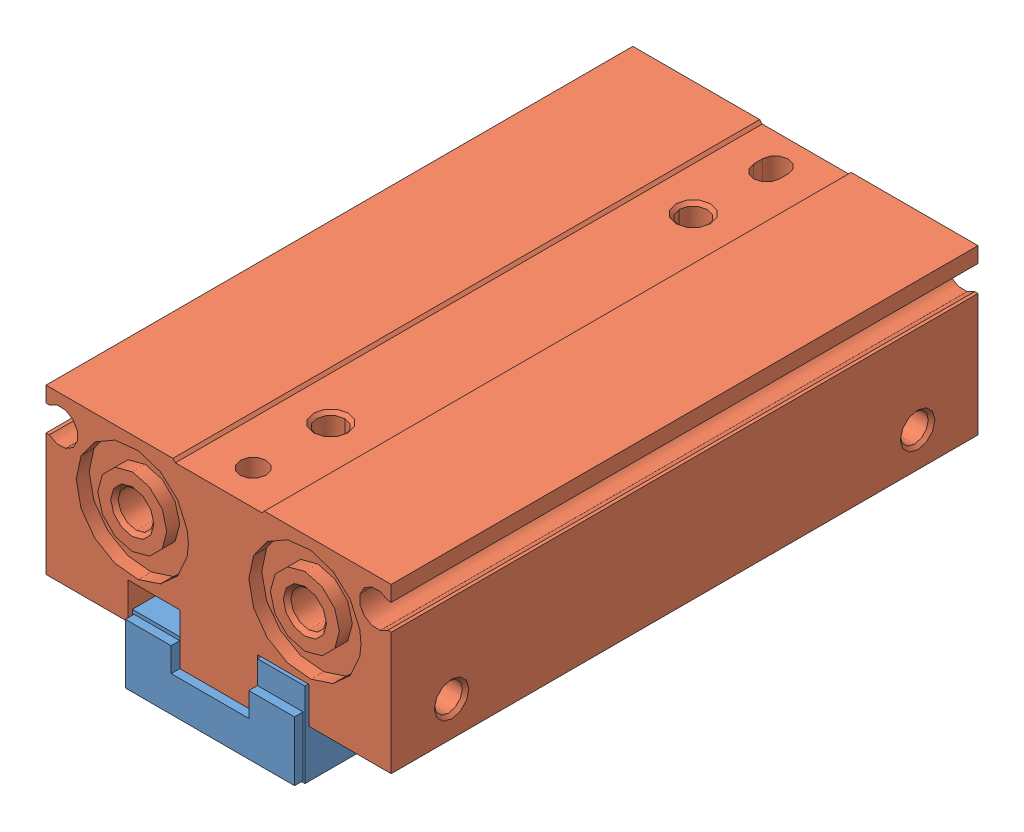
SolidWorks assembly SHF12-24D.sldasm, configuration Default (file format 11000). Lengths in mm.
Overall size (40 25 70).
3 component instances, 2 part files, 0 mates.
Components (placement in the parent):
- SHF12-2402-1: SHF12-2402.sldprt [Default] at (0 -25 -12) x (-1 0 0) z (0 0 -1) size (20 11.8 45)
- SHF12-2402-2: SHF12-2402.sldprt [Default] at (0 -25 12) size (20 11.8 45)
- SHF12-2401-1: SHF12-2401.sldprt [Default] at origin size (40 20.7 68)
